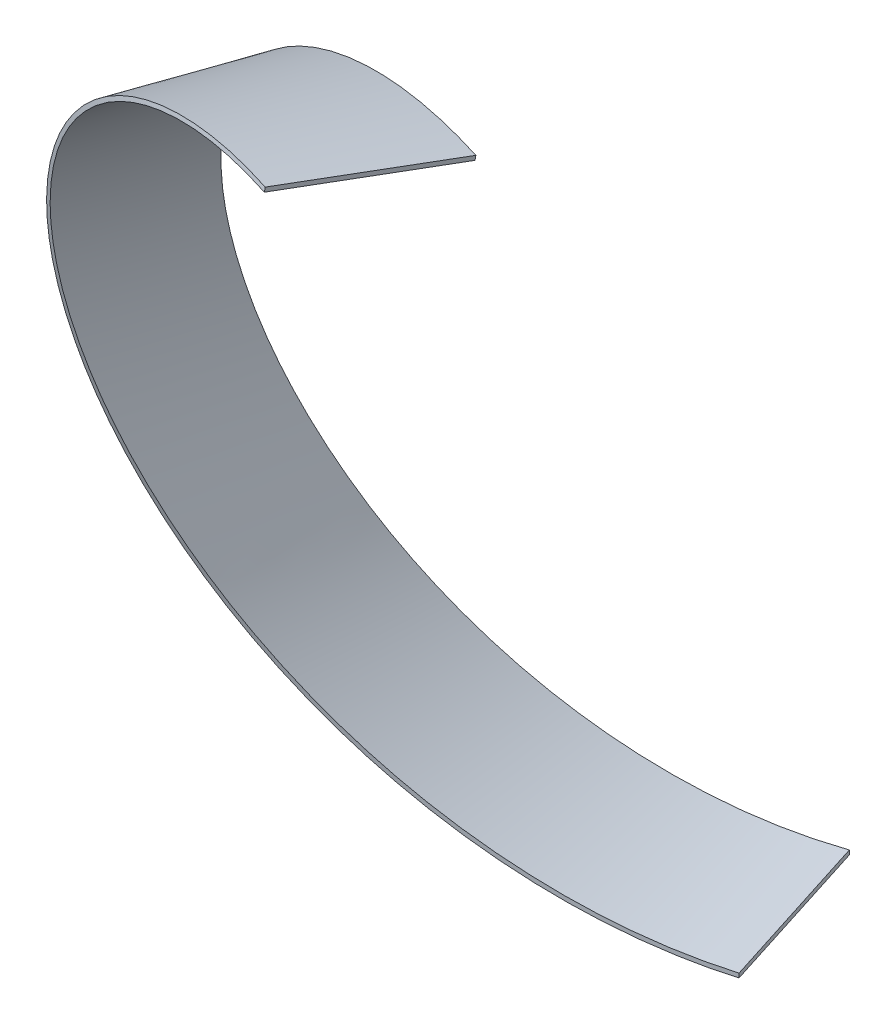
ISO-10303-21;
HEADER;
FILE_DESCRIPTION(('STEP AP214'),'2;1');
FILE_NAME('part.step','',(''),(''),'','','');
FILE_SCHEMA(('AUTOMOTIVE_DESIGN { 1 0 10303 214 1 1 1 1 }'));
ENDSEC;
DATA;
#1=APPLICATION_CONTEXT('core data for automotive mechanical design processes');
#2=APPLICATION_PROTOCOL_DEFINITION('international standard','automotive_design',2000,#1);
#3=PRODUCT_CONTEXT('',#1,'mechanical');
#4=PRODUCT('Part','Part','',(#3));
#5=PRODUCT_RELATED_PRODUCT_CATEGORY('part','',(#4));
#6=PRODUCT_DEFINITION_FORMATION('','',#4);
#7=PRODUCT_DEFINITION_CONTEXT('part definition',#1,'design');
#8=PRODUCT_DEFINITION('design','',#6,#7);
#9=PRODUCT_DEFINITION_SHAPE('','',#8);
#10=(LENGTH_UNIT() NAMED_UNIT(*) SI_UNIT(.MILLI.,.METRE.));
#11=(NAMED_UNIT(*) PLANE_ANGLE_UNIT() SI_UNIT($,.RADIAN.));
#12=(NAMED_UNIT(*) SI_UNIT($,.STERADIAN.) SOLID_ANGLE_UNIT());
#13=UNCERTAINTY_MEASURE_WITH_UNIT(LENGTH_MEASURE(1.E-05),#10,'distance_accuracy_value','');
#14=(GEOMETRIC_REPRESENTATION_CONTEXT(3) GLOBAL_UNCERTAINTY_ASSIGNED_CONTEXT((#13)) GLOBAL_UNIT_ASSIGNED_CONTEXT((#10,
#11,#12)) REPRESENTATION_CONTEXT('',''));
#15=CARTESIAN_POINT('',(0.,0.,0.));
#16=DIRECTION('',(0.,0.,1.));
#17=DIRECTION('',(1.,0.,0.));
#18=AXIS2_PLACEMENT_3D('',#15,#16,#17);
#19=CARTESIAN_POINT('',(2.99485473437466,48.4160698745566,40.5913863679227));
#20=CARTESIAN_POINT('',(0.998284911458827,49.4720232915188,46.8637954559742));
#21=CARTESIAN_POINT('',(-0.998284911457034,50.5279767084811,53.1362045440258));
#22=CARTESIAN_POINT('',(-2.99485473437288,51.5839301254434,59.4086136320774));
#23=CARTESIAN_POINT('',(3.02248953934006,48.9097437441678,40.5170733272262));
#24=CARTESIAN_POINT('',(1.02359311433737,49.9657154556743,46.7887387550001));
#25=CARTESIAN_POINT('',(-0.97546163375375,51.021671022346,53.060356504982));
#26=CARTESIAN_POINT('',(-2.97471118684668,52.0776018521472,59.3319164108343));
#27=B_SPLINE_SURFACE_WITH_KNOTS('',1,3,((#19,#20,#21,#22),(#23,#24,#25,#26)),.UNSPECIFIED.,.F.,
.F.,.F.,(2,2),(4,4),(0.,1.),(-0.01,0.01),.UNSPECIFIED.);
#28=CARTESIAN_POINT('',(3.02248953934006,48.9097437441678,40.5170733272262));
#29=CARTESIAN_POINT('',(2.99485473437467,48.4160698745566,40.5913863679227));
#30=B_SPLINE_CURVE_WITH_KNOTS('',1,(#28,#29),.UNSPECIFIED.,.F.,.F.,(2,2),(0.,1.),.UNSPECIFIED.);
#31=CARTESIAN_POINT('',(3.02248953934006,48.9097437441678,40.5170733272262));
#32=VERTEX_POINT('',#31);
#33=CARTESIAN_POINT('',(2.99485473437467,48.4160698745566,40.5913863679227));
#34=VERTEX_POINT('',#33);
#35=EDGE_CURVE('E13',#32,#34,#30,.T.);
#36=CARTESIAN_POINT('',(3.02248953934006,48.9097437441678,40.5170733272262));
#37=CARTESIAN_POINT('',(1.02359311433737,49.9657154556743,46.7887387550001));
#38=CARTESIAN_POINT('',(-0.97546163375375,51.021671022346,53.060356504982));
#39=CARTESIAN_POINT('',(-2.97471118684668,52.0776018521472,59.3319164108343));
#40=B_SPLINE_CURVE_WITH_KNOTS('',3,(#36,#37,#38,#39),.UNSPECIFIED.,.F.,.F.,(4,4),(-0.01,0.01),.UNSPECIFIED.);
#41=CARTESIAN_POINT('',(-2.97471118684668,52.0776018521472,59.3319164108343));
#42=VERTEX_POINT('',#41);
#43=EDGE_CURVE('E121',#32,#42,#40,.T.);
#44=CARTESIAN_POINT('',(-2.97471118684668,52.0776018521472,59.3319164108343));
#45=CARTESIAN_POINT('',(-2.99485473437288,51.5839301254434,59.4086136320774));
#46=B_SPLINE_CURVE_WITH_KNOTS('',1,(#44,#45),.UNSPECIFIED.,.F.,.F.,(2,2),(0.,1.),.UNSPECIFIED.);
#47=CARTESIAN_POINT('',(-2.99485473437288,51.5839301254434,59.4086136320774));
#48=VERTEX_POINT('',#47);
#49=EDGE_CURVE('E69',#42,#48,#46,.T.);
#50=CARTESIAN_POINT('',(2.99485473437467,48.4160698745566,40.5913863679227));
#51=CARTESIAN_POINT('',(2.74528350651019,48.5480640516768,41.3754375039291));
#52=CARTESIAN_POINT('',(2.24614105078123,48.8120524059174,42.943539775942));
#53=CARTESIAN_POINT('',(1.49742736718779,49.2080349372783,45.2956931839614));
#54=CARTESIAN_POINT('',(0.748713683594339,49.6040174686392,47.6478465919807));
#55=CARTESIAN_POINT('',(0.249571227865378,49.8680058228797,49.2159488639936));
#56=CARTESIAN_POINT('',(-0.249571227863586,50.1319941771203,50.7840511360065));
#57=CARTESIAN_POINT('',(-0.748713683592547,50.3959825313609,52.3521534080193));
#58=CARTESIAN_POINT('',(-1.49742736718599,50.7919650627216,54.7043068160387));
#59=CARTESIAN_POINT('',(-2.24614105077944,51.1879475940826,57.056460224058));
#60=CARTESIAN_POINT('',(-2.7452835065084,51.4519359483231,58.6245624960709));
#61=CARTESIAN_POINT('',(-2.99485473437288,51.5839301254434,59.4086136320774));
#62=B_SPLINE_CURVE_WITH_KNOTS('',3,(#50,#51,#52,#53,#54,#55,#56,#57,#58,#59,#60,#61),
.UNSPECIFIED.,.F.,.F.,(4,1,1,1,2,1,1,1,4),(0.,0.125,0.25,0.375,0.5,0.625,0.75,0.875,1.),.UNSPECIFIED.);
#63=EDGE_CURVE('E256',#34,#48,#62,.T.);
#64=ORIENTED_EDGE('',*,*,#35,.F.);
#65=ORIENTED_EDGE('',*,*,#43,.T.);
#66=ORIENTED_EDGE('',*,*,#49,.T.);
#67=ORIENTED_EDGE('',*,*,#63,.F.);
#68=EDGE_LOOP('',(#64,#65,#66,#67));
#69=FACE_BOUND('',#68,.T.);
#70=ADVANCED_FACE('F55',(#69),#27,.T.);
#71=CARTESIAN_POINT('',(3.03314471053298,-50.,9.52890513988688));
#72=CARTESIAN_POINT('',(-0.360160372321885,-49.9670014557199,10.5665472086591));
#73=CARTESIAN_POINT('',(-3.7616813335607,-49.6116932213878,11.6068194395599));
#74=CARTESIAN_POINT('',(-10.4341611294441,-48.2650291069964,13.6863320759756));
#75=CARTESIAN_POINT('',(-13.7051199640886,-47.2736732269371,14.7255724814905));
#76=CARTESIAN_POINT('',(-20.0015327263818,-44.7022820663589,16.8036620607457));
#77=CARTESIAN_POINT('',(-23.0269866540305,-43.12224678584,17.842511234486));
#78=CARTESIAN_POINT('',(-28.7174468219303,-39.4208650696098,19.9204589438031));
#79=CARTESIAN_POINT('',(-31.3824530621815,-37.2995186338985,20.95955747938));
#80=CARTESIAN_POINT('',(-36.26153547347,-32.6055568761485,23.0378630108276));
#81=CARTESIAN_POINT('',(-38.4756116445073,-30.0329415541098,24.0770700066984));
#82=CARTESIAN_POINT('',(-42.3623515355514,-24.5264842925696,26.1554515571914));
#83=CARTESIAN_POINT('',(-44.0350152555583,-21.5926423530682,27.1946261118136));
#84=CARTESIAN_POINT('',(-46.7905429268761,-15.4806756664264,29.2729597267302));
#85=CARTESIAN_POINT('',(-47.8734068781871,-12.3025509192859,30.3121187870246));
#86=CARTESIAN_POINT('',(-49.4009476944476,-5.81896242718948,32.3904383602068));
#87=CARTESIAN_POINT('',(-49.8456245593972,-2.51349868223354,33.4295988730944));
#88=CARTESIAN_POINT('',(-50.0967912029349,4.09742880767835,35.5079198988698));
#89=CARTESIAN_POINT('',(-49.9032809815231,7.40289255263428,36.5470804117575));
#90=CARTESIAN_POINT('',(-48.878073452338,13.8864810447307,38.6253999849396));
#91=CARTESIAN_POINT('',(-48.0463761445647,17.0646057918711,39.6645590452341));
#92=CARTESIAN_POINT('',(-45.7931817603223,23.1765724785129,41.7428926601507));
#93=CARTESIAN_POINT('',(-44.3716846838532,26.1104144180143,42.7820672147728));
#94=CARTESIAN_POINT('',(-40.9872780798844,31.6168716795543,44.8604487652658));
#95=CARTESIAN_POINT('',(-39.0243685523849,34.189487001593,45.8996557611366));
#96=CARTESIAN_POINT('',(-34.6476194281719,38.8834487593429,47.9779612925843));
#97=CARTESIAN_POINT('',(-32.2337798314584,41.0047951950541,49.0170598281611));
#98=CARTESIAN_POINT('',(-27.0456529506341,44.7061769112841,51.0950075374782));
#99=CARTESIAN_POINT('',(-24.2713656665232,46.286212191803,52.1338567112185));
#100=CARTESIAN_POINT('',(-18.4772861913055,48.857603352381,54.2119462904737));
#101=CARTESIAN_POINT('',(-15.4574940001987,49.8489592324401,55.2511866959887));
#102=CARTESIAN_POINT('',(-9.28734749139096,51.1956233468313,57.3306993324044));
#103=CARTESIAN_POINT('',(-6.13699317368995,51.5509315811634,58.3709715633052));
#104=CARTESIAN_POINT('',(-2.99485473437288,51.5839301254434,59.4086136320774));
#105=CARTESIAN_POINT('',(3.02871389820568,-50.4999783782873,9.53031551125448));
#106=CARTESIAN_POINT('',(-0.392966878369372,-50.4666981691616,10.5786632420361));
#107=CARTESIAN_POINT('',(-3.82279521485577,-50.1083983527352,11.6285076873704));
#108=CARTESIAN_POINT('',(-10.5524436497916,-48.750253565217,13.72490336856));
#109=CARTESIAN_POINT('',(-13.8512727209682,-47.7505934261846,14.7711768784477));
#110=CARTESIAN_POINT('',(-20.2022778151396,-45.1576445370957,16.860580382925));
#111=CARTESIAN_POINT('',(-23.2544751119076,-43.5643522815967,17.9037155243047));
#112=CARTESIAN_POINT('',(-28.9973971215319,-39.8308581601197,19.9874494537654));
#113=CARTESIAN_POINT('',(-31.6871428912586,-37.6912663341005,21.0278714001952));
#114=CARTESIAN_POINT('',(-36.6128980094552,-32.9561055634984,23.1058992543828));
#115=CARTESIAN_POINT('',(-38.8489291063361,-30.3605207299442,24.1435041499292));
#116=CARTESIAN_POINT('',(-42.7762404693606,-24.8024172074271,26.2158213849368));
#117=CARTESIAN_POINT('',(-44.4667672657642,-21.8408650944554,27.250491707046));
#118=CARTESIAN_POINT('',(-47.2526301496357,-15.6695028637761,29.3172878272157));
#119=CARTESIAN_POINT('',(-48.3479744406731,-12.4596659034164,30.3494069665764));
#120=CARTESIAN_POINT('',(-49.8937223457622,-5.90849034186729,32.4115994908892));
#121=CARTESIAN_POINT('',(-50.3437820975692,-2.5683990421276,33.4417543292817));
#122=CARTESIAN_POINT('',(-50.5978334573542,4.11268948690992,35.5011001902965));
#123=CARTESIAN_POINT('',(-50.4018202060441,7.45370583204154,36.530287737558));
#124=CARTESIAN_POINT('',(-49.3630675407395,14.0083153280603,38.5887600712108));
#125=CARTESIAN_POINT('',(-48.5205644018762,17.2205891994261,39.618171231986));
#126=CARTESIAN_POINT('',(-46.23865083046,23.3973304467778,41.6783916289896));
#127=CARTESIAN_POINT('',(-44.7992403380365,26.3618184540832,42.7091971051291));
#128=CARTESIAN_POINT('',(-41.3725553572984,31.9255105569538,44.7731484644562));
#129=CARTESIAN_POINT('',(-39.3860521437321,34.5236431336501,45.8063329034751));
#130=CARTESIAN_POINT('',(-34.9584120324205,39.263032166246,47.8754484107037));
#131=CARTESIAN_POINT('',(-32.5172572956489,41.4043140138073,48.9113728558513));
#132=CARTESIAN_POINT('',(-27.2710955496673,45.1403497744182,50.9863150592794));
#133=CARTESIAN_POINT('',(-24.4671320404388,46.7344474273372,52.0252167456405));
#134=CARTESIAN_POINT('',(-18.6126525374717,49.328384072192,54.1066685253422));
#135=CARTESIAN_POINT('',(-15.5621087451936,50.3282330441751,55.1492192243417));
#136=CARTESIAN_POINT('',(-9.32917348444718,51.6864196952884,57.2389685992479));
#137=CARTESIAN_POINT('',(-6.147834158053,52.044566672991,58.2859008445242));
#138=CARTESIAN_POINT('',(-2.97471118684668,52.0776018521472,59.3319164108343));
#139=B_SPLINE_SURFACE_WITH_KNOTS('',1,3,((#71,#72,#73,#74,#75,#76,#77,#78,#79,#80,#81,#82,#83,
#84,#85,#86,#87,#88,#89,#90,#91,#92,#93,#94,#95,#96,#97,#98,#99,#100,#101,#102,#103,#104),(#105,
#106,#107,#108,#109,#110,#111,#112,#113,#114,#115,#116,#117,#118,#119,#120,#121,#122,#123,#124,
#125,#126,#127,#128,#129,#130,#131,#132,#133,#134,#135,#136,#137,#138)),.UNSPECIFIED.,.F.,.F.,
.F.,(2,2),(4,2,2,2,2,2,2,2,2,2,2,2,2,2,2,2,4),(0.,1.),(0.,0.0625,0.125,0.1875,0.25,0.3125,0.375,
0.4375,0.5,0.5625,0.625,0.6875,0.75,0.8125,0.875,0.9375,1.),.UNSPECIFIED.);
#140=CARTESIAN_POINT('',(-2.97471118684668,52.0776018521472,59.3319164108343));
#141=CARTESIAN_POINT('',(-6.147834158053,52.044566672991,58.2859008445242));
#142=CARTESIAN_POINT('',(-9.32917348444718,51.6864196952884,57.2389685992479));
#143=CARTESIAN_POINT('',(-15.5621087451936,50.3282330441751,55.1492192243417));
#144=CARTESIAN_POINT('',(-18.6126525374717,49.328384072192,54.1066685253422));
#145=CARTESIAN_POINT('',(-24.4671320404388,46.7344474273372,52.0252167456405));
#146=CARTESIAN_POINT('',(-27.2710955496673,45.1403497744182,50.9863150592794));
#147=CARTESIAN_POINT('',(-32.5172572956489,41.4043140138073,48.9113728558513));
#148=CARTESIAN_POINT('',(-34.9584120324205,39.263032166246,47.8754484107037));
#149=CARTESIAN_POINT('',(-39.3860521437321,34.5236431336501,45.8063329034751));
#150=CARTESIAN_POINT('',(-41.3725553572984,31.9255105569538,44.7731484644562));
#151=CARTESIAN_POINT('',(-44.7992403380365,26.3618184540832,42.7091971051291));
#152=CARTESIAN_POINT('',(-46.23865083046,23.3973304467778,41.6783916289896));
#153=CARTESIAN_POINT('',(-48.5205644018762,17.2205891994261,39.618171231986));
#154=CARTESIAN_POINT('',(-49.3630675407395,14.0083153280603,38.5887600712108));
#155=CARTESIAN_POINT('',(-50.4018202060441,7.45370583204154,36.530287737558));
#156=CARTESIAN_POINT('',(-50.5978334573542,4.11268948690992,35.5011001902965));
#157=CARTESIAN_POINT('',(-50.3437820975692,-2.5683990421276,33.4417543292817));
#158=CARTESIAN_POINT('',(-49.8937223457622,-5.90849034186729,32.4115994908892));
#159=CARTESIAN_POINT('',(-48.3479744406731,-12.4596659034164,30.3494069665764));
#160=CARTESIAN_POINT('',(-47.2526301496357,-15.6695028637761,29.3172878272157));
#161=CARTESIAN_POINT('',(-44.4667672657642,-21.8408650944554,27.250491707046));
#162=CARTESIAN_POINT('',(-42.7762404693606,-24.8024172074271,26.2158213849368));
#163=CARTESIAN_POINT('',(-38.8489291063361,-30.3605207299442,24.1435041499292));
#164=CARTESIAN_POINT('',(-36.6128980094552,-32.9561055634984,23.1058992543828));
#165=CARTESIAN_POINT('',(-31.6871428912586,-37.6912663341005,21.0278714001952));
#166=CARTESIAN_POINT('',(-28.9973971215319,-39.8308581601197,19.9874494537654));
#167=CARTESIAN_POINT('',(-23.2544751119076,-43.5643522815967,17.9037155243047));
#168=CARTESIAN_POINT('',(-20.2022778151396,-45.1576445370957,16.860580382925));
#169=CARTESIAN_POINT('',(-13.8512727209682,-47.7505934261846,14.7711768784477));
#170=CARTESIAN_POINT('',(-10.5524436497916,-48.750253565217,13.72490336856));
#171=CARTESIAN_POINT('',(-3.82279521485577,-50.1083983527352,11.6285076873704));
#172=CARTESIAN_POINT('',(-0.392966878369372,-50.4666981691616,10.5786632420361));
#173=CARTESIAN_POINT('',(3.02871389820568,-50.4999783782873,9.53031551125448));
#174=B_SPLINE_CURVE_WITH_KNOTS('',3,(#140,#141,#142,#143,#144,#145,#146,#147,#148,#149,#150,
#151,#152,#153,#154,#155,#156,#157,#158,#159,#160,#161,#162,#163,#164,#165,#166,#167,#168,#169,
#170,#171,#172,#173),.UNSPECIFIED.,.F.,.F.,(4,2,2,2,2,2,2,2,2,2,2,2,2,2,2,2,4),(0.,0.0625,0.125,
0.1875,0.25,0.3125,0.375,0.4375,0.5,0.5625,0.625,0.6875,0.75,0.8125,0.875,0.9375,1.),.UNSPECIFIED.);
#175=CARTESIAN_POINT('',(3.02871389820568,-50.4999783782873,9.53031551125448));
#176=VERTEX_POINT('',#175);
#177=EDGE_CURVE('E289',#42,#176,#174,.T.);
#178=CARTESIAN_POINT('',(3.02871389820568,-50.4999783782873,9.53031551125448));
#179=CARTESIAN_POINT('',(3.03314471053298,-50.,9.52890513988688));
#180=B_SPLINE_CURVE_WITH_KNOTS('',1,(#178,#179),.UNSPECIFIED.,.F.,.F.,(2,2),(0.,1.),.UNSPECIFIED.);
#181=CARTESIAN_POINT('',(3.03314471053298,-50.,9.52890513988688));
#182=VERTEX_POINT('',#181);
#183=EDGE_CURVE('E111',#176,#182,#180,.T.);
#184=CARTESIAN_POINT('',(-2.99485473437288,51.5839301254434,59.4086136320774));
#185=CARTESIAN_POINT('',(-6.13699317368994,51.5509315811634,58.3709715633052));
#186=CARTESIAN_POINT('',(-15.588056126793,50.4850068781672,55.2501548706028));
#187=CARTESIAN_POINT('',(-30.3606117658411,43.9381083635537,50.0565324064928));
#188=CARTESIAN_POINT('',(-43.7623062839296,29.5860962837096,43.8211931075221));
#189=CARTESIAN_POINT('',(-50.6670513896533,10.8993647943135,37.586243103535));
#190=CARTESIAN_POINT('',(-49.9135514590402,-9.31543466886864,31.3512756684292));
#191=CARTESIAN_POINT('',(-41.5018064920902,-28.002166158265,25.1163256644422));
#192=CARTESIAN_POINT('',(-26.5931121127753,-42.3541782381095,18.8809863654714));
#193=CARTESIAN_POINT('',(-10.5647232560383,-48.9010767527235,13.6873639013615));
#194=CARTESIAN_POINT('',(-0.360160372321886,-49.9670014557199,10.5665472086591));
#195=CARTESIAN_POINT('',(3.03314471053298,-50.,9.52890513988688));
#196=B_SPLINE_CURVE_WITH_KNOTS('',3,(#184,#185,#186,#187,#188,#189,#190,#191,#192,#193,#194,
#195),.UNSPECIFIED.,.F.,.F.,(4,1,1,1,1,1,1,1,1,4),(0.,0.0625,0.1875,0.3125,0.4375,0.5625,0.6875,
0.8125,0.9375,1.),.UNSPECIFIED.);
#197=EDGE_CURVE('E129',#48,#182,#196,.T.);
#198=ORIENTED_EDGE('',*,*,#49,.F.);
#199=ORIENTED_EDGE('',*,*,#177,.T.);
#200=ORIENTED_EDGE('',*,*,#183,.T.);
#201=ORIENTED_EDGE('',*,*,#197,.F.);
#202=EDGE_LOOP('',(#198,#199,#200,#201));
#203=FACE_BOUND('',#202,.T.);
#204=ADVANCED_FACE('F152',(#203),#139,.F.);
#205=CARTESIAN_POINT('',(3.03314471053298,-50.0000000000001,9.52890513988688));
#206=CARTESIAN_POINT('',(1.01104823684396,-50.,3.17630171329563));
#207=CARTESIAN_POINT('',(-1.01104823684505,-50.,-3.17630171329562));
#208=CARTESIAN_POINT('',(-3.03314471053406,-49.9999999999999,-9.52890513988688));
#209=CARTESIAN_POINT('',(3.02871389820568,-50.4999783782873,9.53031551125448));
#210=CARTESIAN_POINT('',(1.00947206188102,-50.5000062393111,3.17680342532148));
#211=CARTESIAN_POINT('',(-1.0095786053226,-50.5000094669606,-3.17676951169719));
#212=CARTESIAN_POINT('',(-3.02839562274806,-50.4999751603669,-9.53041682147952));
#213=B_SPLINE_SURFACE_WITH_KNOTS('',1,3,((#205,#206,#207,#208),(#209,#210,#211,#212)),
.UNSPECIFIED.,.F.,.F.,.F.,(2,2),(4,4),(0.,1.),(-0.01,0.01),.UNSPECIFIED.);
#214=CARTESIAN_POINT('',(3.02871389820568,-50.4999783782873,9.53031551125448));
#215=CARTESIAN_POINT('',(1.00947206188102,-50.5000062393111,3.17680342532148));
#216=CARTESIAN_POINT('',(-1.0095786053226,-50.5000094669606,-3.17676951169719));
#217=CARTESIAN_POINT('',(-3.02839562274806,-50.4999751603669,-9.53041682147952));
#218=B_SPLINE_CURVE_WITH_KNOTS('',3,(#214,#215,#216,#217),.UNSPECIFIED.,.F.,.F.,(4,4),(-0.01,
0.01),.UNSPECIFIED.);
#219=CARTESIAN_POINT('',(-3.02839562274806,-50.4999751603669,-9.53041682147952));
#220=VERTEX_POINT('',#219);
#221=EDGE_CURVE('E119',#176,#220,#218,.T.);
#222=CARTESIAN_POINT('',(-3.02839562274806,-50.4999751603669,-9.53041682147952));
#223=CARTESIAN_POINT('',(-3.03314471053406,-49.9999999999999,-9.52890513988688));
#224=B_SPLINE_CURVE_WITH_KNOTS('',1,(#222,#223),.UNSPECIFIED.,.F.,.F.,(2,2),(0.,1.),.UNSPECIFIED.);
#225=CARTESIAN_POINT('',(-3.03314471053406,-50.,-9.52890513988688));
#226=VERTEX_POINT('',#225);
#227=EDGE_CURVE('E99',#220,#226,#224,.T.);
#228=CARTESIAN_POINT('',(3.03314471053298,-50.,9.52890513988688));
#229=CARTESIAN_POINT('',(2.78038265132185,-50.,8.73482971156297));
#230=CARTESIAN_POINT('',(2.2748585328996,-50.,7.14667885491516));
#231=CARTESIAN_POINT('',(1.51657235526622,-50.,4.76445256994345));
#232=CARTESIAN_POINT('',(0.758286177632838,-50.,2.38222628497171));
#233=CARTESIAN_POINT('',(0.252762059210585,-50.,0.794075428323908));
#234=CARTESIAN_POINT('',(-0.252762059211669,-50.,-0.794075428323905));
#235=CARTESIAN_POINT('',(-0.758286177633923,-50.,-2.38222628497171));
#236=CARTESIAN_POINT('',(-1.5165723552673,-50.,-4.76445256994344));
#237=CARTESIAN_POINT('',(-2.27485853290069,-49.9999999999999,-7.14667885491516));
#238=CARTESIAN_POINT('',(-2.78038265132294,-50.,-8.73482971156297));
#239=CARTESIAN_POINT('',(-3.03314471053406,-50.,-9.52890513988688));
#240=B_SPLINE_CURVE_WITH_KNOTS('',3,(#228,#229,#230,#231,#232,#233,#234,#235,#236,#237,#238,
#239),.UNSPECIFIED.,.F.,.F.,(4,1,1,1,2,1,1,1,4),(0.,0.125,0.25,0.375,0.5,0.625,0.75,0.875,1.),.UNSPECIFIED.);
#241=EDGE_CURVE('E112',#182,#226,#240,.T.);
#242=ORIENTED_EDGE('',*,*,#183,.F.);
#243=ORIENTED_EDGE('',*,*,#221,.T.);
#244=ORIENTED_EDGE('',*,*,#227,.T.);
#245=ORIENTED_EDGE('',*,*,#241,.F.);
#246=EDGE_LOOP('',(#242,#243,#244,#245));
#247=FACE_BOUND('',#246,.T.);
#248=ADVANCED_FACE('F126',(#247),#213,.T.);
#249=CARTESIAN_POINT('',(-3.03314471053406,-50.,-9.52890513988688));
#250=CARTESIAN_POINT('',(-6.17528314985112,-50.03299854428,-8.48625092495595));
#251=CARTESIAN_POINT('',(-9.32563746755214,-49.743687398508,-7.44096654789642));
#252=CARTESIAN_POINT('',(-15.4957839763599,-48.5290174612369,-5.35142961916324));
#253=CARTESIAN_POINT('',(-18.5155761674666,-47.6036586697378,-4.30717706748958));
#254=CARTESIAN_POINT('',(-24.3096556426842,-45.1642616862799,-2.21906319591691));
#255=CARTESIAN_POINT('',(-27.0839429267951,-43.6502234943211,-1.17520187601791));
#256=CARTESIAN_POINT('',(-32.2720698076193,-40.0808359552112,0.912770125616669));
#257=CARTESIAN_POINT('',(-34.6859094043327,-38.02548660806,1.95688080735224));
#258=CARTESIAN_POINT('',(-39.0626585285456,-33.4635190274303,4.04521063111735));
#259=CARTESIAN_POINT('',(-41.0255680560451,-30.9569007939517,5.08942977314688));
#260=CARTESIAN_POINT('',(-44.4099746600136,-25.5824377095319,7.17783561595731));
#261=CARTESIAN_POINT('',(-45.8314717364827,-22.7145928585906,8.2220223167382));
#262=CARTESIAN_POINT('',(-48.0846661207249,-16.734620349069,10.3103802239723));
#263=CARTESIAN_POINT('',(-48.9163634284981,-13.6224926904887,11.3545514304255));
#264=CARTESIAN_POINT('',(-49.941570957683,-7.2708983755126,13.4428952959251));
#265=CARTESIAN_POINT('',(-50.1350811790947,-4.0314317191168,14.4870679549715));
#266=CARTESIAN_POINT('',(-49.8839145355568,2.4475015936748,16.5754132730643));
#267=CARTESIAN_POINT('',(-49.4392376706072,5.68696825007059,17.6195859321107));
#268=CARTESIAN_POINT('',(-47.9116968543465,12.0385625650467,19.7079297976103));
#269=CARTESIAN_POINT('',(-46.8288329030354,15.150690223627,20.7521010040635));
#270=CARTESIAN_POINT('',(-44.0733052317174,21.1306627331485,22.8404589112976));
#271=CARTESIAN_POINT('',(-42.4006415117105,23.9985075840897,23.8846456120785));
#272=CARTESIAN_POINT('',(-38.5139016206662,29.3729706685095,25.9730514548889));
#273=CARTESIAN_POINT('',(-36.2998254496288,31.879588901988,27.0172705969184));
#274=CARTESIAN_POINT('',(-31.4207430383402,36.4415564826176,29.1056004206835));
#275=CARTESIAN_POINT('',(-28.7557367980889,38.4969058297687,30.1497111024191));
#276=CARTESIAN_POINT('',(-23.0652766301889,42.0662933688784,32.2376831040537));
#277=CARTESIAN_POINT('',(-20.0398227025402,43.5803315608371,33.2815444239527));
#278=CARTESIAN_POINT('',(-13.743409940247,46.0197285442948,35.3696582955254));
#279=CARTESIAN_POINT('',(-10.4724511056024,46.9450873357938,36.413910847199));
#280=CARTESIAN_POINT('',(-3.79997130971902,48.1597572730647,38.5034477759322));
#281=CARTESIAN_POINT('',(-0.3984503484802,48.4490684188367,39.5487321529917));
#282=CARTESIAN_POINT('',(2.99485473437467,48.4160698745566,40.5913863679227));
#283=CARTESIAN_POINT('',(-3.02839562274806,-50.4999751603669,-9.53041682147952));
#284=CARTESIAN_POINT('',(-6.20092510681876,-50.5332970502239,-8.47629523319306));
#285=CARTESIAN_POINT('',(-9.38171164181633,-50.2411908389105,-7.42071562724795));
#286=CARTESIAN_POINT('',(-15.6133678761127,-49.0145708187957,-5.3130102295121));
#287=CARTESIAN_POINT('',(-18.6631726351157,-48.0802463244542,-4.26118342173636));
#288=CARTESIAN_POINT('',(-24.5158703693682,-45.6171773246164,-2.16093543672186));
#289=CARTESIAN_POINT('',(-27.3187901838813,-44.0884272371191,-1.11250806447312));
#290=CARTESIAN_POINT('',(-32.5626620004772,-40.4832493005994,0.98151563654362));
#291=CARTESIAN_POINT('',(-35.0025743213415,-38.4075009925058,2.02692538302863));
#292=CARTESIAN_POINT('',(-39.4278695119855,-33.7995494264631,4.11465421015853));
#293=CARTESIAN_POINT('',(-41.413275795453,-31.2673223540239,5.15697130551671));
#294=CARTESIAN_POINT('',(-44.8382582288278,-25.8356826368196,7.23850592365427));
#295=CARTESIAN_POINT('',(-46.277077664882,-22.9373434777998,8.27768796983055));
#296=CARTESIAN_POINT('',(-48.5583946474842,-16.8927529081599,10.3534676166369));
#297=CARTESIAN_POINT('',(-49.4008937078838,-13.7464710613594,11.3900582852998));
#298=CARTESIAN_POINT('',(-50.4398825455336,-7.32330114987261,13.4613472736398));
#299=CARTESIAN_POINT('',(-50.6361152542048,-4.04774120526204,14.496139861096));
#300=CARTESIAN_POINT('',(-50.3821133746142,2.5029520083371,16.5650879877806));
#301=CARTESIAN_POINT('',(-49.9318728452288,5.778102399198,17.5992413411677));
#302=CARTESIAN_POINT('',(-48.3848893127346,12.1995149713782,19.6680302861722));
#303=CARTESIAN_POINT('',(-47.2885045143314,15.3444829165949,20.702785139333));
#304=CARTESIAN_POINT('',(-44.4997464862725,21.3856334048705,22.7739497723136));
#305=CARTESIAN_POINT('',(-42.8073689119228,24.2818385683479,23.8103545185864));
#306=CARTESIAN_POINT('',(-38.8758997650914,29.7084260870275,25.8855883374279));
#307=CARTESIAN_POINT('',(-36.6376229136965,32.2378408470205,26.9244360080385));
#308=CARTESIAN_POINT('',(-31.7074786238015,36.8399082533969,29.0047618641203));
#309=CARTESIAN_POINT('',(-29.015589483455,38.9125791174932,30.0462347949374));
#310=CARTESIAN_POINT('',(-23.2688328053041,42.5117353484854,32.1320357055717));
#311=CARTESIAN_POINT('',(-20.214981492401,44.0376533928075,33.1762397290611));
#312=CARTESIAN_POINT('',(-13.8612525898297,46.4958484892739,35.2679929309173));
#313=CARTESIAN_POINT('',(-10.5613513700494,47.4281296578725,36.3155433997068));
#314=CARTESIAN_POINT('',(-3.83006969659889,48.6518658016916,38.4149459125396));
#315=CARTESIAN_POINT('',(-0.399659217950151,48.9431720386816,39.466547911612));
#316=CARTESIAN_POINT('',(3.02248953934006,48.9097437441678,40.5170733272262));
#317=B_SPLINE_SURFACE_WITH_KNOTS('',1,3,((#249,#250,#251,#252,#253,#254,#255,#256,#257,#258,
#259,#260,#261,#262,#263,#264,#265,#266,#267,#268,#269,#270,#271,#272,#273,#274,#275,#276,#277,
#278,#279,#280,#281,#282),(#283,#284,#285,#286,#287,#288,#289,#290,#291,#292,#293,#294,#295,
#296,#297,#298,#299,#300,#301,#302,#303,#304,#305,#306,#307,#308,#309,#310,#311,#312,#313,#314,
#315,#316)),.UNSPECIFIED.,.F.,.F.,.F.,(2,2),(4,2,2,2,2,2,2,2,2,2,2,2,2,2,2,2,4),(0.,1.),(0.,
0.0625,0.125,0.1875,0.25,0.3125,0.375,0.4375,0.5,0.5625,0.625,0.6875,0.75,0.8125,0.875,0.9375,
1.),.UNSPECIFIED.);
#318=CARTESIAN_POINT('',(-3.02839562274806,-50.4999751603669,-9.53041682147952));
#319=CARTESIAN_POINT('',(-6.20092510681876,-50.5332970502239,-8.47629523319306));
#320=CARTESIAN_POINT('',(-9.38171164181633,-50.2411908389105,-7.42071562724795));
#321=CARTESIAN_POINT('',(-15.6133678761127,-49.0145708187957,-5.3130102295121));
#322=CARTESIAN_POINT('',(-18.6631726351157,-48.0802463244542,-4.26118342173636));
#323=CARTESIAN_POINT('',(-24.5158703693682,-45.6171773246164,-2.16093543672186));
#324=CARTESIAN_POINT('',(-27.3187901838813,-44.0884272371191,-1.11250806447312));
#325=CARTESIAN_POINT('',(-32.5626620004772,-40.4832493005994,0.98151563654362));
#326=CARTESIAN_POINT('',(-35.0025743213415,-38.4075009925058,2.02692538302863));
#327=CARTESIAN_POINT('',(-39.4278695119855,-33.7995494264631,4.11465421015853));
#328=CARTESIAN_POINT('',(-41.413275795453,-31.2673223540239,5.15697130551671));
#329=CARTESIAN_POINT('',(-44.8382582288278,-25.8356826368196,7.23850592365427));
#330=CARTESIAN_POINT('',(-46.277077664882,-22.9373434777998,8.27768796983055));
#331=CARTESIAN_POINT('',(-48.5583946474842,-16.8927529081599,10.3534676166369));
#332=CARTESIAN_POINT('',(-49.4008937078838,-13.7464710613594,11.3900582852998));
#333=CARTESIAN_POINT('',(-50.4398825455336,-7.32330114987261,13.4613472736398));
#334=CARTESIAN_POINT('',(-50.6361152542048,-4.04774120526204,14.496139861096));
#335=CARTESIAN_POINT('',(-50.3821133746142,2.5029520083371,16.5650879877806));
#336=CARTESIAN_POINT('',(-49.9318728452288,5.778102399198,17.5992413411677));
#337=CARTESIAN_POINT('',(-48.3848893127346,12.1995149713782,19.6680302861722));
#338=CARTESIAN_POINT('',(-47.2885045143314,15.3444829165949,20.702785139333));
#339=CARTESIAN_POINT('',(-44.4997464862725,21.3856334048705,22.7739497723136));
#340=CARTESIAN_POINT('',(-42.8073689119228,24.2818385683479,23.8103545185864));
#341=CARTESIAN_POINT('',(-38.8758997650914,29.7084260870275,25.8855883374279));
#342=CARTESIAN_POINT('',(-36.6376229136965,32.2378408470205,26.9244360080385));
#343=CARTESIAN_POINT('',(-31.7074786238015,36.8399082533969,29.0047618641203));
#344=CARTESIAN_POINT('',(-29.015589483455,38.9125791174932,30.0462347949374));
#345=CARTESIAN_POINT('',(-23.2688328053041,42.5117353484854,32.1320357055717));
#346=CARTESIAN_POINT('',(-20.214981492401,44.0376533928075,33.1762397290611));
#347=CARTESIAN_POINT('',(-13.8612525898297,46.4958484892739,35.2679929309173));
#348=CARTESIAN_POINT('',(-10.5613513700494,47.4281296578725,36.3155433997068));
#349=CARTESIAN_POINT('',(-3.83006969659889,48.6518658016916,38.4149459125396));
#350=CARTESIAN_POINT('',(-0.399659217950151,48.9431720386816,39.466547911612));
#351=CARTESIAN_POINT('',(3.02248953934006,48.9097437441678,40.5170733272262));
#352=B_SPLINE_CURVE_WITH_KNOTS('',3,(#318,#319,#320,#321,#322,#323,#324,#325,#326,#327,#328,
#329,#330,#331,#332,#333,#334,#335,#336,#337,#338,#339,#340,#341,#342,#343,#344,#345,#346,#347,
#348,#349,#350,#351),.UNSPECIFIED.,.F.,.F.,(4,2,2,2,2,2,2,2,2,2,2,2,2,2,2,2,4),(0.,0.0625,0.125,
0.1875,0.25,0.3125,0.375,0.4375,0.5,0.5625,0.625,0.6875,0.75,0.8125,0.875,0.9375,1.),.UNSPECIFIED.);
#353=EDGE_CURVE('E101',#220,#32,#352,.T.);
#354=CARTESIAN_POINT('',(-3.03314471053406,-50.,-9.52890513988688));
#355=CARTESIAN_POINT('',(-6.17528314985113,-50.03299854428,-8.48625092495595));
#356=CARTESIAN_POINT('',(-15.6263461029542,-49.165065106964,-5.35039779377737));
#357=CARTESIAN_POINT('',(-30.3989017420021,-42.9481520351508,-0.13171459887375));
#358=CARTESIAN_POINT('',(-43.8005962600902,-28.9921224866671,6.13369757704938));
#359=CARTESIAN_POINT('',(-50.7053413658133,-10.7013735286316,12.3987204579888));
#360=CARTESIAN_POINT('',(-49.9518414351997,9.11744340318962,18.6637607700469));
#361=CARTESIAN_POINT('',(-41.5400964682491,27.4081923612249,24.9287836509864));
#362=CARTESIAN_POINT('',(-26.6314020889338,41.3642219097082,31.1941958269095));
#363=CARTESIAN_POINT('',(-10.6030132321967,47.5811349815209,36.4128790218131));
#364=CARTESIAN_POINT('',(-0.398450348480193,48.4490684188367,39.5487321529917));
#365=CARTESIAN_POINT('',(2.99485473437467,48.4160698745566,40.5913863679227));
#366=B_SPLINE_CURVE_WITH_KNOTS('',3,(#354,#355,#356,#357,#358,#359,#360,#361,#362,#363,#364,
#365),.UNSPECIFIED.,.F.,.F.,(4,1,1,1,1,1,1,1,1,4),(0.,0.0625,0.1875,0.3125,0.4375,0.5625,0.6875,
0.8125,0.9375,1.),.UNSPECIFIED.);
#367=EDGE_CURVE('E104',#226,#34,#366,.T.);
#368=ORIENTED_EDGE('',*,*,#353,.T.);
#369=ORIENTED_EDGE('',*,*,#35,.T.);
#370=ORIENTED_EDGE('',*,*,#367,.F.);
#371=ORIENTED_EDGE('',*,*,#227,.F.);
#372=EDGE_LOOP('',(#368,#369,#370,#371));
#373=FACE_BOUND('',#372,.T.);
#374=ADVANCED_FACE('F57',(#373),#317,.T.);
#375=CARTESIAN_POINT('',(3.03314471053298,-50.,9.52890513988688));
#376=CARTESIAN_POINT('',(-0.360160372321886,-49.9670014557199,10.5665472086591));
#377=CARTESIAN_POINT('',(-10.5647232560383,-48.9010767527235,13.6873639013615));
#378=CARTESIAN_POINT('',(-26.5931121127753,-42.3541782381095,18.8809863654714));
#379=CARTESIAN_POINT('',(-41.5018064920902,-28.002166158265,25.1163256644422));
#380=CARTESIAN_POINT('',(-49.9135514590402,-9.31543466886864,31.3512756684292));
#381=CARTESIAN_POINT('',(-50.6670513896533,10.8993647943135,37.586243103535));
#382=CARTESIAN_POINT('',(-43.7623062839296,29.5860962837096,43.8211931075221));
#383=CARTESIAN_POINT('',(-30.3606117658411,43.9381083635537,50.0565324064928));
#384=CARTESIAN_POINT('',(-15.588056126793,50.4850068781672,55.2501548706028));
#385=CARTESIAN_POINT('',(-6.13699317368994,51.5509315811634,58.3709715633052));
#386=CARTESIAN_POINT('',(-2.99485473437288,51.5839301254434,59.4086136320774));
#387=CARTESIAN_POINT('',(2.78038265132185,-50.,8.73482971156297));
#388=CARTESIAN_POINT('',(-0.602457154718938,-49.9697513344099,9.77268061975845));
#389=CARTESIAN_POINT('',(-10.7756242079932,-48.9120762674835,12.8941238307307));
#390=CARTESIAN_POINT('',(-26.7516866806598,-42.3789271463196,18.0887904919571));
#391=CARTESIAN_POINT('',(-41.5975893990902,-28.0434143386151,24.3253828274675));
#392=CARTESIAN_POINT('',(-49.9465427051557,-9.37318212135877,30.5615858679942));
#393=CARTESIAN_POINT('',(-50.6372509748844,10.8251180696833,36.7978063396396));
#394=CARTESIAN_POINT('',(-43.6697142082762,29.4953502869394,43.0340093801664));
#395=CARTESIAN_POINT('',(-30.2052280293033,43.8308630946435,49.2706017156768));
#396=CARTESIAN_POINT('',(-15.3803460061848,50.3640122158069,54.4652683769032));
#397=CARTESIAN_POINT('',(-5.89788722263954,51.4216872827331,57.5867115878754));
#398=CARTESIAN_POINT('',(-2.7452835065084,51.4519359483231,58.6245624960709));
#399=CARTESIAN_POINT('',(2.2748585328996,-50.,7.14667885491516));
#400=CARTESIAN_POINT('',(-1.08705071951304,-49.9752510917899,8.1849474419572));
#401=CARTESIAN_POINT('',(-11.1974261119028,-48.9340752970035,11.3076436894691));
#402=CARTESIAN_POINT('',(-27.0688358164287,-42.4284249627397,16.5043987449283));
#403=CARTESIAN_POINT('',(-41.7891552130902,-28.1259106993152,22.7434971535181));
#404=CARTESIAN_POINT('',(-50.0125251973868,-9.48867702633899,28.9822062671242));
#405=CARTESIAN_POINT('',(-50.5776501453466,10.676624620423,35.220932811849));
#406=CARTESIAN_POINT('',(-43.4845300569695,29.3138582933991,41.4596419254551));
#407=CARTESIAN_POINT('',(-29.8944605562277,43.6163725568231,47.6987403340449));
#408=CARTESIAN_POINT('',(-14.9649257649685,50.1220228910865,52.895495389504));
#409=CARTESIAN_POINT('',(-5.41967532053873,51.1631986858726,56.018191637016));
#410=CARTESIAN_POINT('',(-2.24614105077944,51.1879475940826,57.056460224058));
#411=CARTESIAN_POINT('',(1.51657235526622,-50.,4.76445256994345));
#412=CARTESIAN_POINT('',(-1.8139410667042,-49.9835007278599,5.80334767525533));
#413=CARTESIAN_POINT('',(-11.8301289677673,-48.9670738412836,8.92792347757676));
#414=CARTESIAN_POINT('',(-27.544559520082,-42.5026716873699,14.1278111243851));
#415=CARTESIAN_POINT('',(-42.0765039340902,-28.2496552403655,20.370668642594));
#416=CARTESIAN_POINT('',(-50.1114989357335,-9.66191938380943,26.6131368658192));
#417=CARTESIAN_POINT('',(-50.4882489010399,10.4538844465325,32.855622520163));
#418=CARTESIAN_POINT('',(-43.2067538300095,29.0416203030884,39.0980907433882));
#419=CARTESIAN_POINT('',(-29.4283093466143,43.2946367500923,45.340948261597));
#420=CARTESIAN_POINT('',(-14.3417954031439,49.7590389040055,50.5408359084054));
#421=CARTESIAN_POINT('',(-4.7023574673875,50.7754657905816,53.6654117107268));
#422=CARTESIAN_POINT('',(-1.49742736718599,50.7919650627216,54.7043068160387));
#423=CARTESIAN_POINT('',(0.758286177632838,-50.,2.38222628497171));
#424=CARTESIAN_POINT('',(-2.54083141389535,-49.99175036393,3.42174790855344));
#425=CARTESIAN_POINT('',(-12.4628318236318,-49.0000723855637,6.54820326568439));
#426=CARTESIAN_POINT('',(-28.0202832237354,-42.576918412,11.751223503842));
#427=CARTESIAN_POINT('',(-42.3638526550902,-28.3733997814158,17.9978401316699));
#428=CARTESIAN_POINT('',(-50.2104726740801,-9.83516174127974,24.2440674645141));
#429=CARTESIAN_POINT('',(-50.3988476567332,10.231144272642,30.4903122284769));
#430=CARTESIAN_POINT('',(-42.9289776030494,28.7693823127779,36.7365395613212));
#431=CARTESIAN_POINT('',(-28.9621581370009,42.9729009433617,42.9831561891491));
#432=CARTESIAN_POINT('',(-13.7186650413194,49.3960549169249,48.1861764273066));
#433=CARTESIAN_POINT('',(-3.98503961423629,50.3877328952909,51.3126317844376));
#434=CARTESIAN_POINT('',(-0.748713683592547,50.3959825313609,52.3521534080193));
#435=CARTESIAN_POINT('',(0.252762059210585,-50.,0.794075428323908));
#436=CARTESIAN_POINT('',(-3.02542497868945,-49.99725012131,1.83401473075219));
#437=CARTESIAN_POINT('',(-12.8846337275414,-49.0220714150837,4.96172312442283));
#438=CARTESIAN_POINT('',(-28.3374323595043,-42.6264162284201,10.1668317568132));
#439=CARTESIAN_POINT('',(-42.5554184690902,-28.455896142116,16.4159544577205));
#440=CARTESIAN_POINT('',(-50.2764551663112,-9.95065664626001,22.6646878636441));
#441=CARTESIAN_POINT('',(-50.3392468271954,10.0826508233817,28.9134387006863));
#442=CARTESIAN_POINT('',(-42.7437934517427,28.5878903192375,35.1621721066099));
#443=CARTESIAN_POINT('',(-28.6513906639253,42.7584104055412,41.4112948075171));
#444=CARTESIAN_POINT('',(-13.303244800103,49.1540655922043,46.6164034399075));
#445=CARTESIAN_POINT('',(-3.50682771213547,50.1292442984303,49.7441118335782));
#446=CARTESIAN_POINT('',(-0.249571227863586,50.1319941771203,50.7840511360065));
#447=CARTESIAN_POINT('',(-0.252762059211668,-50.,-0.794075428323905));
#448=CARTESIAN_POINT('',(-3.51001854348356,-50.00274987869,0.246281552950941));
#449=CARTESIAN_POINT('',(-13.3064356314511,-49.0440704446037,3.37524298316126));
#450=CARTESIAN_POINT('',(-28.6545814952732,-42.6759140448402,8.58244000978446));
#451=CARTESIAN_POINT('',(-42.7469842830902,-28.5383925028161,14.8340687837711));
#452=CARTESIAN_POINT('',(-50.3424376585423,-10.0661515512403,21.085308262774));
#453=CARTESIAN_POINT('',(-50.2796459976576,9.93415737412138,27.3365651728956));
#454=CARTESIAN_POINT('',(-42.558609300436,28.4063983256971,33.5878046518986));
#455=CARTESIAN_POINT('',(-28.3406231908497,42.5439198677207,39.8394334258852));
#456=CARTESIAN_POINT('',(-12.8878245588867,48.9120762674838,45.0466304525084));
#457=CARTESIAN_POINT('',(-3.02861581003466,49.8707557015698,48.1755918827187));
#458=CARTESIAN_POINT('',(0.249571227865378,49.8680058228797,49.2159488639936));
#459=CARTESIAN_POINT('',(-0.758286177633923,-50.,-2.38222628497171));
#460=CARTESIAN_POINT('',(-3.99461210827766,-50.0082496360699,-1.34145162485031));
#461=CARTESIAN_POINT('',(-13.7282375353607,-49.0660694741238,1.78876284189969));
#462=CARTESIAN_POINT('',(-28.9717306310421,-42.7254118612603,6.99804826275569));
#463=CARTESIAN_POINT('',(-42.9385500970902,-28.6208888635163,13.2521831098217));
#464=CARTESIAN_POINT('',(-50.4084201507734,-10.1816464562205,19.505928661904));
#465=CARTESIAN_POINT('',(-50.2200451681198,9.78566392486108,25.7596916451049));
#466=CARTESIAN_POINT('',(-42.3734251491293,28.2249063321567,32.0134371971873));
#467=CARTESIAN_POINT('',(-28.0298557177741,42.3294293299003,38.2675720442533));
#468=CARTESIAN_POINT('',(-12.4724043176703,48.6700869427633,43.4768574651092));
#469=CARTESIAN_POINT('',(-2.55040390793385,49.6122671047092,46.6070719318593));
#470=CARTESIAN_POINT('',(0.748713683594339,49.6040174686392,47.6478465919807));
#471=CARTESIAN_POINT('',(-1.5165723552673,-50.,-4.76445256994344));
#472=CARTESIAN_POINT('',(-4.72150245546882,-50.01649927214,-3.72305139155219));
#473=CARTESIAN_POINT('',(-14.3609403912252,-49.0990680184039,-0.590957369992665));
#474=CARTESIAN_POINT('',(-29.4474543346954,-42.7996585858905,4.62146064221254));
#475=CARTESIAN_POINT('',(-43.2258988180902,-28.7446334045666,10.8793545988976));
#476=CARTESIAN_POINT('',(-50.50739388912,-10.3548888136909,17.1368592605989));
#477=CARTESIAN_POINT('',(-50.1306439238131,9.56292375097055,23.394381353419));
#478=CARTESIAN_POINT('',(-42.0956489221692,27.9526683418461,29.6518860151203));
#479=CARTESIAN_POINT('',(-27.5637045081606,42.0076935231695,35.9097799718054));
#480=CARTESIAN_POINT('',(-11.8492739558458,48.3071029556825,41.1221979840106));
#481=CARTESIAN_POINT('',(-1.83308605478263,49.2245342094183,44.2542920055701));
#482=CARTESIAN_POINT('',(1.49742736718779,49.2080349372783,45.2956931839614));
#483=CARTESIAN_POINT('',(-2.27485853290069,-49.9999999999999,-7.14667885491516));
#484=CARTESIAN_POINT('',(-5.44839280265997,-50.02474890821,-6.10465115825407));
#485=CARTESIAN_POINT('',(-14.9936432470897,-49.1320665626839,-2.97067758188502));
#486=CARTESIAN_POINT('',(-29.9231780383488,-42.8739053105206,2.24487302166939));
#487=CARTESIAN_POINT('',(-43.5132475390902,-28.8683779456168,8.50652608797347));
#488=CARTESIAN_POINT('',(-50.6063676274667,-10.5281311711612,14.7677898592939));
#489=CARTESIAN_POINT('',(-50.0412426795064,9.34018357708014,21.0290710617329));
#490=CARTESIAN_POINT('',(-41.8178726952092,27.6804303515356,27.2903348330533));
#491=CARTESIAN_POINT('',(-27.0975532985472,41.6859577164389,33.5519878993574));
#492=CARTESIAN_POINT('',(-11.2261435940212,47.9441189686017,38.7675385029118));
#493=CARTESIAN_POINT('',(-1.11576820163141,48.8368013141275,41.9015120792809));
#494=CARTESIAN_POINT('',(2.24614105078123,48.8120524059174,42.943539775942));
#495=CARTESIAN_POINT('',(-2.78038265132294,-50.,-8.73482971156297));
#496=CARTESIAN_POINT('',(-5.93298636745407,-50.03024866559,-7.69238433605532));
#497=CARTESIAN_POINT('',(-15.4154451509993,-49.1540655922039,-4.55715772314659));
#498=CARTESIAN_POINT('',(-30.2403271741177,-42.9234031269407,0.660481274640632));
#499=CARTESIAN_POINT('',(-43.7048133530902,-28.950874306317,6.92464041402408));
#500=CARTESIAN_POINT('',(-50.6723501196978,-10.6436260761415,13.1884102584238));
#501=CARTESIAN_POINT('',(-49.9816418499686,9.19169012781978,19.4521975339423));
#502=CARTESIAN_POINT('',(-41.6326885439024,27.4989383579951,25.715967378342));
#503=CARTESIAN_POINT('',(-26.7867858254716,41.4714671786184,31.9801265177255));
#504=CARTESIAN_POINT('',(-10.8107233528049,47.7021296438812,37.1977655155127));
#505=CARTESIAN_POINT('',(-0.6375562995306,48.578312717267,40.3329921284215));
#506=CARTESIAN_POINT('',(2.74528350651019,48.5480640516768,41.3754375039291));
#507=CARTESIAN_POINT('',(-3.03314471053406,-50.,-9.52890513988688));
#508=CARTESIAN_POINT('',(-6.17528314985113,-50.03299854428,-8.48625092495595));
#509=CARTESIAN_POINT('',(-15.6263461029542,-49.165065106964,-5.35039779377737));
#510=CARTESIAN_POINT('',(-30.3989017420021,-42.9481520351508,-0.13171459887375));
#511=CARTESIAN_POINT('',(-43.8005962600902,-28.9921224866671,6.13369757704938));
#512=CARTESIAN_POINT('',(-50.7053413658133,-10.7013735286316,12.3987204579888));
#513=CARTESIAN_POINT('',(-49.9518414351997,9.11744340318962,18.6637607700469));
#514=CARTESIAN_POINT('',(-41.5400964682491,27.4081923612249,24.9287836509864));
#515=CARTESIAN_POINT('',(-26.6314020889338,41.3642219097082,31.1941958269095));
#516=CARTESIAN_POINT('',(-10.6030132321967,47.5811349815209,36.4128790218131));
#517=CARTESIAN_POINT('',(-0.398450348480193,48.4490684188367,39.5487321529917));
#518=CARTESIAN_POINT('',(2.99485473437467,48.4160698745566,40.5913863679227));
#519=B_SPLINE_SURFACE_WITH_KNOTS('',3,3,((#375,#376,#377,#378,#379,#380,#381,#382,#383,#384,
#385,#386),(#387,#388,#389,#390,#391,#392,#393,#394,#395,#396,#397,#398),(#399,#400,#401,#402,
#403,#404,#405,#406,#407,#408,#409,#410),(#411,#412,#413,#414,#415,#416,#417,#418,#419,#420,
#421,#422),(#423,#424,#425,#426,#427,#428,#429,#430,#431,#432,#433,#434),(#435,#436,#437,#438,
#439,#440,#441,#442,#443,#444,#445,#446),(#447,#448,#449,#450,#451,#452,#453,#454,#455,#456,
#457,#458),(#459,#460,#461,#462,#463,#464,#465,#466,#467,#468,#469,#470),(#471,#472,#473,#474,
#475,#476,#477,#478,#479,#480,#481,#482),(#483,#484,#485,#486,#487,#488,#489,#490,#491,#492,
#493,#494),(#495,#496,#497,#498,#499,#500,#501,#502,#503,#504,#505,#506),(#507,#508,#509,#510,
#511,#512,#513,#514,#515,#516,#517,#518)),.UNSPECIFIED.,.F.,.F.,.F.,(4,1,1,1,2,1,1,1,4),(4,1,1,
1,1,1,1,1,1,4),(0.,0.125,0.25,0.375,0.5,0.625,0.75,0.875,1.),(0.,0.0625,0.1875,0.3125,0.4375,
0.5625,0.6875,0.8125,0.9375,1.),.UNSPECIFIED.);
#520=ORIENTED_EDGE('',*,*,#241,.T.);
#521=ORIENTED_EDGE('',*,*,#367,.T.);
#522=ORIENTED_EDGE('',*,*,#63,.T.);
#523=ORIENTED_EDGE('',*,*,#197,.T.);
#524=EDGE_LOOP('',(#520,#521,#522,#523));
#525=FACE_BOUND('',#524,.T.);
#526=ADVANCED_FACE('F153',(#525),#519,.T.);
#527=CARTESIAN_POINT('',(3.03314471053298,-50.,9.52890513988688));
#528=CARTESIAN_POINT('',(-0.360160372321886,-49.9670014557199,10.5665472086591));
#529=CARTESIAN_POINT('',(-10.5647232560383,-48.9010767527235,13.6873639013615));
#530=CARTESIAN_POINT('',(-26.5931121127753,-42.3541782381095,18.8809863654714));
#531=CARTESIAN_POINT('',(-41.5018064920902,-28.002166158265,25.1163256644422));
#532=CARTESIAN_POINT('',(-49.9135514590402,-9.31543466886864,31.3512756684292));
#533=CARTESIAN_POINT('',(-50.6670513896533,10.8993647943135,37.586243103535));
#534=CARTESIAN_POINT('',(-43.7623062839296,29.5860962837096,43.8211931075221));
#535=CARTESIAN_POINT('',(-30.3606117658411,43.9381083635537,50.0565324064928));
#536=CARTESIAN_POINT('',(-15.588056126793,50.4850068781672,55.2501548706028));
#537=CARTESIAN_POINT('',(-6.13699317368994,51.5509315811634,58.3709715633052));
#538=CARTESIAN_POINT('',(-2.99485473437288,51.5839301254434,59.4086136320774));
#539=CARTESIAN_POINT('',(2.78038265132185,-50.,8.73482971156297));
#540=CARTESIAN_POINT('',(-0.602457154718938,-49.9697513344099,9.77268061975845));
#541=CARTESIAN_POINT('',(-10.7756242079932,-48.9120762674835,12.8941238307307));
#542=CARTESIAN_POINT('',(-26.7516866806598,-42.3789271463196,18.0887904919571));
#543=CARTESIAN_POINT('',(-41.5975893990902,-28.0434143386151,24.3253828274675));
#544=CARTESIAN_POINT('',(-49.9465427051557,-9.37318212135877,30.5615858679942));
#545=CARTESIAN_POINT('',(-50.6372509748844,10.8251180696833,36.7978063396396));
#546=CARTESIAN_POINT('',(-43.6697142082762,29.4953502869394,43.0340093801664));
#547=CARTESIAN_POINT('',(-30.2052280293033,43.8308630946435,49.2706017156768));
#548=CARTESIAN_POINT('',(-15.3803460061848,50.3640122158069,54.4652683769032));
#549=CARTESIAN_POINT('',(-5.89788722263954,51.4216872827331,57.5867115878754));
#550=CARTESIAN_POINT('',(-2.7452835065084,51.4519359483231,58.6245624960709));
#551=CARTESIAN_POINT('',(2.2748585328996,-50.,7.14667885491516));
#552=CARTESIAN_POINT('',(-1.08705071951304,-49.9752510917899,8.1849474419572));
#553=CARTESIAN_POINT('',(-11.1974261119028,-48.9340752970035,11.3076436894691));
#554=CARTESIAN_POINT('',(-27.0688358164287,-42.4284249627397,16.5043987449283));
#555=CARTESIAN_POINT('',(-41.7891552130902,-28.1259106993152,22.7434971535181));
#556=CARTESIAN_POINT('',(-50.0125251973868,-9.48867702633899,28.9822062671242));
#557=CARTESIAN_POINT('',(-50.5776501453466,10.676624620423,35.220932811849));
#558=CARTESIAN_POINT('',(-43.4845300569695,29.3138582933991,41.4596419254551));
#559=CARTESIAN_POINT('',(-29.8944605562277,43.6163725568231,47.6987403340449));
#560=CARTESIAN_POINT('',(-14.9649257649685,50.1220228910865,52.895495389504));
#561=CARTESIAN_POINT('',(-5.41967532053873,51.1631986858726,56.018191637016));
#562=CARTESIAN_POINT('',(-2.24614105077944,51.1879475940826,57.056460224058));
#563=CARTESIAN_POINT('',(1.51657235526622,-50.,4.76445256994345));
#564=CARTESIAN_POINT('',(-1.8139410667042,-49.9835007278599,5.80334767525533));
#565=CARTESIAN_POINT('',(-11.8301289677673,-48.9670738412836,8.92792347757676));
#566=CARTESIAN_POINT('',(-27.544559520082,-42.5026716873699,14.1278111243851));
#567=CARTESIAN_POINT('',(-42.0765039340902,-28.2496552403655,20.370668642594));
#568=CARTESIAN_POINT('',(-50.1114989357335,-9.66191938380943,26.6131368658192));
#569=CARTESIAN_POINT('',(-50.4882489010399,10.4538844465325,32.855622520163));
#570=CARTESIAN_POINT('',(-43.2067538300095,29.0416203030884,39.0980907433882));
#571=CARTESIAN_POINT('',(-29.4283093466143,43.2946367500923,45.340948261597));
#572=CARTESIAN_POINT('',(-14.3417954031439,49.7590389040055,50.5408359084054));
#573=CARTESIAN_POINT('',(-4.7023574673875,50.7754657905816,53.6654117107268));
#574=CARTESIAN_POINT('',(-1.49742736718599,50.7919650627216,54.7043068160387));
#575=CARTESIAN_POINT('',(0.758286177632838,-50.,2.38222628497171));
#576=CARTESIAN_POINT('',(-2.54083141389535,-49.99175036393,3.42174790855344));
#577=CARTESIAN_POINT('',(-12.4628318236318,-49.0000723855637,6.54820326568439));
#578=CARTESIAN_POINT('',(-28.0202832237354,-42.576918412,11.751223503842));
#579=CARTESIAN_POINT('',(-42.3638526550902,-28.3733997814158,17.9978401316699));
#580=CARTESIAN_POINT('',(-50.2104726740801,-9.83516174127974,24.2440674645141));
#581=CARTESIAN_POINT('',(-50.3988476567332,10.231144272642,30.4903122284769));
#582=CARTESIAN_POINT('',(-42.9289776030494,28.7693823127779,36.7365395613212));
#583=CARTESIAN_POINT('',(-28.9621581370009,42.9729009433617,42.9831561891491));
#584=CARTESIAN_POINT('',(-13.7186650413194,49.3960549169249,48.1861764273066));
#585=CARTESIAN_POINT('',(-3.98503961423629,50.3877328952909,51.3126317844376));
#586=CARTESIAN_POINT('',(-0.748713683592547,50.3959825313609,52.3521534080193));
#587=CARTESIAN_POINT('',(0.252762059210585,-50.,0.794075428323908));
#588=CARTESIAN_POINT('',(-3.02542497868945,-49.99725012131,1.83401473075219));
#589=CARTESIAN_POINT('',(-12.8846337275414,-49.0220714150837,4.96172312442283));
#590=CARTESIAN_POINT('',(-28.3374323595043,-42.6264162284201,10.1668317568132));
#591=CARTESIAN_POINT('',(-42.5554184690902,-28.455896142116,16.4159544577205));
#592=CARTESIAN_POINT('',(-50.2764551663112,-9.95065664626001,22.6646878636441));
#593=CARTESIAN_POINT('',(-50.3392468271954,10.0826508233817,28.9134387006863));
#594=CARTESIAN_POINT('',(-42.7437934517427,28.5878903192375,35.1621721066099));
#595=CARTESIAN_POINT('',(-28.6513906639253,42.7584104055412,41.4112948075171));
#596=CARTESIAN_POINT('',(-13.303244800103,49.1540655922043,46.6164034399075));
#597=CARTESIAN_POINT('',(-3.50682771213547,50.1292442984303,49.7441118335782));
#598=CARTESIAN_POINT('',(-0.249571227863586,50.1319941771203,50.7840511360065));
#599=CARTESIAN_POINT('',(-0.252762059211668,-50.,-0.794075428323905));
#600=CARTESIAN_POINT('',(-3.51001854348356,-50.00274987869,0.246281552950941));
#601=CARTESIAN_POINT('',(-13.3064356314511,-49.0440704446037,3.37524298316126));
#602=CARTESIAN_POINT('',(-28.6545814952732,-42.6759140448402,8.58244000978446));
#603=CARTESIAN_POINT('',(-42.7469842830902,-28.5383925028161,14.8340687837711));
#604=CARTESIAN_POINT('',(-50.3424376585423,-10.0661515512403,21.085308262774));
#605=CARTESIAN_POINT('',(-50.2796459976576,9.93415737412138,27.3365651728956));
#606=CARTESIAN_POINT('',(-42.558609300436,28.4063983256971,33.5878046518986));
#607=CARTESIAN_POINT('',(-28.3406231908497,42.5439198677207,39.8394334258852));
#608=CARTESIAN_POINT('',(-12.8878245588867,48.9120762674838,45.0466304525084));
#609=CARTESIAN_POINT('',(-3.02861581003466,49.8707557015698,48.1755918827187));
#610=CARTESIAN_POINT('',(0.249571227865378,49.8680058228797,49.2159488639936));
#611=CARTESIAN_POINT('',(-0.758286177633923,-50.,-2.38222628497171));
#612=CARTESIAN_POINT('',(-3.99461210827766,-50.0082496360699,-1.34145162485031));
#613=CARTESIAN_POINT('',(-13.7282375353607,-49.0660694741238,1.78876284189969));
#614=CARTESIAN_POINT('',(-28.9717306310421,-42.7254118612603,6.99804826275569));
#615=CARTESIAN_POINT('',(-42.9385500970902,-28.6208888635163,13.2521831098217));
#616=CARTESIAN_POINT('',(-50.4084201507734,-10.1816464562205,19.505928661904));
#617=CARTESIAN_POINT('',(-50.2200451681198,9.78566392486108,25.7596916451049));
#618=CARTESIAN_POINT('',(-42.3734251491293,28.2249063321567,32.0134371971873));
#619=CARTESIAN_POINT('',(-28.0298557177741,42.3294293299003,38.2675720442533));
#620=CARTESIAN_POINT('',(-12.4724043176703,48.6700869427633,43.4768574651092));
#621=CARTESIAN_POINT('',(-2.55040390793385,49.6122671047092,46.6070719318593));
#622=CARTESIAN_POINT('',(0.748713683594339,49.6040174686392,47.6478465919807));
#623=CARTESIAN_POINT('',(-1.5165723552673,-50.,-4.76445256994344));
#624=CARTESIAN_POINT('',(-4.72150245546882,-50.01649927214,-3.72305139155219));
#625=CARTESIAN_POINT('',(-14.3609403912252,-49.0990680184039,-0.590957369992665));
#626=CARTESIAN_POINT('',(-29.4474543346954,-42.7996585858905,4.62146064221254));
#627=CARTESIAN_POINT('',(-43.2258988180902,-28.7446334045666,10.8793545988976));
#628=CARTESIAN_POINT('',(-50.50739388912,-10.3548888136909,17.1368592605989));
#629=CARTESIAN_POINT('',(-50.1306439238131,9.56292375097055,23.394381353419));
#630=CARTESIAN_POINT('',(-42.0956489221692,27.9526683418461,29.6518860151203));
#631=CARTESIAN_POINT('',(-27.5637045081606,42.0076935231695,35.9097799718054));
#632=CARTESIAN_POINT('',(-11.8492739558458,48.3071029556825,41.1221979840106));
#633=CARTESIAN_POINT('',(-1.83308605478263,49.2245342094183,44.2542920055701));
#634=CARTESIAN_POINT('',(1.49742736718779,49.2080349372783,45.2956931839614));
#635=CARTESIAN_POINT('',(-2.27485853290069,-49.9999999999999,-7.14667885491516));
#636=CARTESIAN_POINT('',(-5.44839280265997,-50.02474890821,-6.10465115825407));
#637=CARTESIAN_POINT('',(-14.9936432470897,-49.1320665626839,-2.97067758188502));
#638=CARTESIAN_POINT('',(-29.9231780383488,-42.8739053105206,2.24487302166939));
#639=CARTESIAN_POINT('',(-43.5132475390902,-28.8683779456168,8.50652608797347));
#640=CARTESIAN_POINT('',(-50.6063676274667,-10.5281311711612,14.7677898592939));
#641=CARTESIAN_POINT('',(-50.0412426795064,9.34018357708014,21.0290710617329));
#642=CARTESIAN_POINT('',(-41.8178726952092,27.6804303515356,27.2903348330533));
#643=CARTESIAN_POINT('',(-27.0975532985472,41.6859577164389,33.5519878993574));
#644=CARTESIAN_POINT('',(-11.2261435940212,47.9441189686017,38.7675385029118));
#645=CARTESIAN_POINT('',(-1.11576820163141,48.8368013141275,41.9015120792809));
#646=CARTESIAN_POINT('',(2.24614105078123,48.8120524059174,42.943539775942));
#647=CARTESIAN_POINT('',(-2.78038265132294,-50.,-8.73482971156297));
#648=CARTESIAN_POINT('',(-5.93298636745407,-50.03024866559,-7.69238433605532));
#649=CARTESIAN_POINT('',(-15.4154451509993,-49.1540655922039,-4.55715772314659));
#650=CARTESIAN_POINT('',(-30.2403271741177,-42.9234031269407,0.660481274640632));
#651=CARTESIAN_POINT('',(-43.7048133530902,-28.950874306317,6.92464041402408));
#652=CARTESIAN_POINT('',(-50.6723501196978,-10.6436260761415,13.1884102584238));
#653=CARTESIAN_POINT('',(-49.9816418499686,9.19169012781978,19.4521975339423));
#654=CARTESIAN_POINT('',(-41.6326885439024,27.4989383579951,25.715967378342));
#655=CARTESIAN_POINT('',(-26.7867858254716,41.4714671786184,31.9801265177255));
#656=CARTESIAN_POINT('',(-10.8107233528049,47.7021296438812,37.1977655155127));
#657=CARTESIAN_POINT('',(-0.6375562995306,48.578312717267,40.3329921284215));
#658=CARTESIAN_POINT('',(2.74528350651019,48.5480640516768,41.3754375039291));
#659=CARTESIAN_POINT('',(-3.03314471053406,-50.,-9.52890513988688));
#660=CARTESIAN_POINT('',(-6.17528314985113,-50.03299854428,-8.48625092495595));
#661=CARTESIAN_POINT('',(-15.6263461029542,-49.165065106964,-5.35039779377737));
#662=CARTESIAN_POINT('',(-30.3989017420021,-42.9481520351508,-0.13171459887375));
#663=CARTESIAN_POINT('',(-43.8005962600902,-28.9921224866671,6.13369757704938));
#664=CARTESIAN_POINT('',(-50.7053413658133,-10.7013735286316,12.3987204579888));
#665=CARTESIAN_POINT('',(-49.9518414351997,9.11744340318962,18.6637607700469));
#666=CARTESIAN_POINT('',(-41.5400964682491,27.4081923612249,24.9287836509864));
#667=CARTESIAN_POINT('',(-26.6314020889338,41.3642219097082,31.1941958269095));
#668=CARTESIAN_POINT('',(-10.6030132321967,47.5811349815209,36.4128790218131));
#669=CARTESIAN_POINT('',(-0.398450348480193,48.4490684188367,39.5487321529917));
#670=CARTESIAN_POINT('',(2.99485473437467,48.4160698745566,40.5913863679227));
#671=B_SPLINE_SURFACE_WITH_KNOTS('',3,3,((#527,#528,#529,#530,#531,#532,#533,#534,#535,#536,
#537,#538),(#539,#540,#541,#542,#543,#544,#545,#546,#547,#548,#549,#550),(#551,#552,#553,#554,
#555,#556,#557,#558,#559,#560,#561,#562),(#563,#564,#565,#566,#567,#568,#569,#570,#571,#572,
#573,#574),(#575,#576,#577,#578,#579,#580,#581,#582,#583,#584,#585,#586),(#587,#588,#589,#590,
#591,#592,#593,#594,#595,#596,#597,#598),(#599,#600,#601,#602,#603,#604,#605,#606,#607,#608,
#609,#610),(#611,#612,#613,#614,#615,#616,#617,#618,#619,#620,#621,#622),(#623,#624,#625,#626,
#627,#628,#629,#630,#631,#632,#633,#634),(#635,#636,#637,#638,#639,#640,#641,#642,#643,#644,
#645,#646),(#647,#648,#649,#650,#651,#652,#653,#654,#655,#656,#657,#658),(#659,#660,#661,#662,
#663,#664,#665,#666,#667,#668,#669,#670)),.UNSPECIFIED.,.F.,.F.,.F.,(4,1,1,1,2,1,1,1,4),(4,1,1,
1,1,1,1,1,1,4),(0.,0.125,0.25,0.375,0.5,0.625,0.75,0.875,1.),(0.,0.0625,0.1875,0.3125,0.4375,
0.5625,0.6875,0.8125,0.9375,1.),.UNSPECIFIED.);
#672=OFFSET_SURFACE('',#671,-0.5,.F.);
#673=ORIENTED_EDGE('',*,*,#221,.F.);
#674=ORIENTED_EDGE('',*,*,#177,.F.);
#675=ORIENTED_EDGE('',*,*,#43,.F.);
#676=ORIENTED_EDGE('',*,*,#353,.F.);
#677=EDGE_LOOP('',(#673,#674,#675,#676));
#678=FACE_BOUND('',#677,.T.);
#679=ADVANCED_FACE('F117',(#678),#672,.F.);
#680=CLOSED_SHELL('',(#70,#204,#248,#374,#526,#679));
#681=MANIFOLD_SOLID_BREP('B2',#680);
#682=ADVANCED_BREP_SHAPE_REPRESENTATION('',(#18,#681),#14);
#683=SHAPE_DEFINITION_REPRESENTATION(#9,#682);
ENDSEC;
END-ISO-10303-21;
